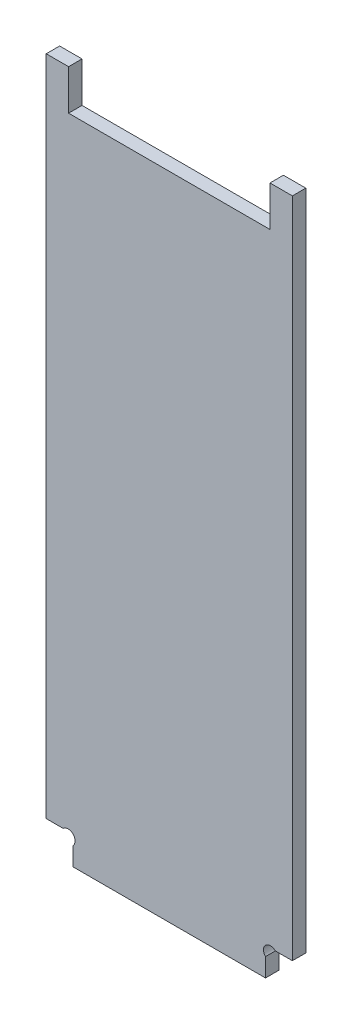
ISO-10303-21;
HEADER;
FILE_DESCRIPTION(('STEP AP214'),'2;1');
FILE_NAME('part.step','',(''),(''),'','','');
FILE_SCHEMA(('AUTOMOTIVE_DESIGN { 1 0 10303 214 1 1 1 1 }'));
ENDSEC;
DATA;
#1=APPLICATION_CONTEXT('core data for automotive mechanical design processes');
#2=APPLICATION_PROTOCOL_DEFINITION('international standard','automotive_design',2000,#1);
#3=PRODUCT_CONTEXT('',#1,'mechanical');
#4=PRODUCT('Part','Part','',(#3));
#5=PRODUCT_RELATED_PRODUCT_CATEGORY('part','',(#4));
#6=PRODUCT_DEFINITION_FORMATION('','',#4);
#7=PRODUCT_DEFINITION_CONTEXT('part definition',#1,'design');
#8=PRODUCT_DEFINITION('design','',#6,#7);
#9=PRODUCT_DEFINITION_SHAPE('','',#8);
#10=(LENGTH_UNIT() NAMED_UNIT(*) SI_UNIT(.MILLI.,.METRE.));
#11=(NAMED_UNIT(*) PLANE_ANGLE_UNIT() SI_UNIT($,.RADIAN.));
#12=(NAMED_UNIT(*) SI_UNIT($,.STERADIAN.) SOLID_ANGLE_UNIT());
#13=UNCERTAINTY_MEASURE_WITH_UNIT(LENGTH_MEASURE(1.E-05),#10,'distance_accuracy_value','');
#14=(GEOMETRIC_REPRESENTATION_CONTEXT(3) GLOBAL_UNCERTAINTY_ASSIGNED_CONTEXT((#13)) GLOBAL_UNIT_ASSIGNED_CONTEXT((#10,
#11,#12)) REPRESENTATION_CONTEXT('',''));
#15=CARTESIAN_POINT('',(0.,0.,0.));
#16=DIRECTION('',(0.,0.,1.));
#17=DIRECTION('',(1.,0.,0.));
#18=AXIS2_PLACEMENT_3D('',#15,#16,#17);
#19=CARTESIAN_POINT('',(5.,139.,3.));
#20=DIRECTION('',(0.,-1.,0.));
#21=DIRECTION('',(1.,0.,0.));
#22=AXIS2_PLACEMENT_3D('',#19,#20,#21);
#23=PLANE('',#22);
#24=DIRECTION('',(-1.,0.,0.));
#25=VECTOR('',#24,1.);
#26=CARTESIAN_POINT('',(5.,139.,0.));
#27=LINE('',#26,#25);
#28=CARTESIAN_POINT('',(49.9999999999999,139.,0.));
#29=VERTEX_POINT('',#28);
#30=CARTESIAN_POINT('',(5.,139.,0.));
#31=VERTEX_POINT('',#30);
#32=EDGE_CURVE('E130',#29,#31,#27,.T.);
#33=ORIENTED_EDGE('',*,*,#32,.T.);
#34=DIRECTION('',(0.,0.,-1.));
#35=VECTOR('',#34,1.);
#36=CARTESIAN_POINT('',(5.,139.,3.));
#37=LINE('',#36,#35);
#38=CARTESIAN_POINT('',(5.,139.,3.));
#39=VERTEX_POINT('',#38);
#40=EDGE_CURVE('E11',#39,#31,#37,.T.);
#41=ORIENTED_EDGE('',*,*,#40,.F.);
#42=DIRECTION('',(-1.,0.,0.));
#43=VECTOR('',#42,1.);
#44=CARTESIAN_POINT('',(5.,139.,3.));
#45=LINE('',#44,#43);
#46=CARTESIAN_POINT('',(49.9999999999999,139.,3.));
#47=VERTEX_POINT('',#46);
#48=EDGE_CURVE('E169',#47,#39,#45,.T.);
#49=ORIENTED_EDGE('',*,*,#48,.F.);
#50=DIRECTION('',(0.,0.,-1.));
#51=VECTOR('',#50,1.);
#52=CARTESIAN_POINT('',(49.9999999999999,139.,3.));
#53=LINE('',#52,#51);
#54=EDGE_CURVE('E143',#47,#29,#53,.T.);
#55=ORIENTED_EDGE('',*,*,#54,.T.);
#56=EDGE_LOOP('',(#33,#41,#49,#55));
#57=FACE_BOUND('',#56,.T.);
#58=ADVANCED_FACE('F26',(#57),#23,.F.);
#59=CARTESIAN_POINT('',(5.,148.,3.));
#60=DIRECTION('',(-1.,0.,0.));
#61=DIRECTION('',(0.,-1.,0.));
#62=AXIS2_PLACEMENT_3D('',#59,#60,#61);
#63=PLANE('',#62);
#64=DIRECTION('',(0.,1.,0.));
#65=VECTOR('',#64,1.);
#66=CARTESIAN_POINT('',(5.,148.,0.));
#67=LINE('',#66,#65);
#68=CARTESIAN_POINT('',(5.,148.,0.));
#69=VERTEX_POINT('',#68);
#70=EDGE_CURVE('E126',#31,#69,#67,.T.);
#71=ORIENTED_EDGE('',*,*,#70,.T.);
#72=DIRECTION('',(0.,0.,-1.));
#73=VECTOR('',#72,1.);
#74=CARTESIAN_POINT('',(5.,148.,3.));
#75=LINE('',#74,#73);
#76=CARTESIAN_POINT('',(5.,148.,3.));
#77=VERTEX_POINT('',#76);
#78=EDGE_CURVE('E33',#77,#69,#75,.T.);
#79=ORIENTED_EDGE('',*,*,#78,.F.);
#80=DIRECTION('',(0.,1.,0.));
#81=VECTOR('',#80,1.);
#82=CARTESIAN_POINT('',(5.,148.,3.));
#83=LINE('',#82,#81);
#84=EDGE_CURVE('E139',#39,#77,#83,.T.);
#85=ORIENTED_EDGE('',*,*,#84,.F.);
#86=ORIENTED_EDGE('',*,*,#40,.T.);
#87=EDGE_LOOP('',(#71,#79,#85,#86));
#88=FACE_BOUND('',#87,.T.);
#89=ADVANCED_FACE('F138',(#88),#63,.F.);
#90=CARTESIAN_POINT('',(0.,148.,3.));
#91=DIRECTION('',(0.,-1.,0.));
#92=DIRECTION('',(0.,0.,-1.));
#93=AXIS2_PLACEMENT_3D('',#90,#91,#92);
#94=PLANE('',#93);
#95=DIRECTION('',(-1.,0.,0.));
#96=VECTOR('',#95,1.);
#97=CARTESIAN_POINT('',(0.,148.,0.));
#98=LINE('',#97,#96);
#99=CARTESIAN_POINT('',(0.,148.,0.));
#100=VERTEX_POINT('',#99);
#101=EDGE_CURVE('E132',#69,#100,#98,.T.);
#102=ORIENTED_EDGE('',*,*,#101,.T.);
#103=DIRECTION('',(0.,0.,-1.));
#104=VECTOR('',#103,1.);
#105=CARTESIAN_POINT('',(0.,148.,3.));
#106=LINE('',#105,#104);
#107=CARTESIAN_POINT('',(0.,148.,3.));
#108=VERTEX_POINT('',#107);
#109=EDGE_CURVE('E225',#108,#100,#106,.T.);
#110=ORIENTED_EDGE('',*,*,#109,.F.);
#111=DIRECTION('',(-1.,0.,0.));
#112=VECTOR('',#111,1.);
#113=CARTESIAN_POINT('',(0.,148.,3.));
#114=LINE('',#113,#112);
#115=EDGE_CURVE('E172',#77,#108,#114,.T.);
#116=ORIENTED_EDGE('',*,*,#115,.F.);
#117=ORIENTED_EDGE('',*,*,#78,.T.);
#118=EDGE_LOOP('',(#102,#110,#116,#117));
#119=FACE_BOUND('',#118,.T.);
#120=ADVANCED_FACE('F229',(#119),#94,.F.);
#121=CARTESIAN_POINT('',(0.,148.,3.));
#122=DIRECTION('',(1.,0.,0.));
#123=DIRECTION('',(0.,1.,0.));
#124=AXIS2_PLACEMENT_3D('',#121,#122,#123);
#125=PLANE('',#124);
#126=DIRECTION('',(0.,-1.,0.));
#127=VECTOR('',#126,1.);
#128=CARTESIAN_POINT('',(0.,148.,0.));
#129=LINE('',#128,#127);
#130=CARTESIAN_POINT('',(0.,0.,0.));
#131=VERTEX_POINT('',#130);
#132=EDGE_CURVE('E147',#100,#131,#129,.T.);
#133=ORIENTED_EDGE('',*,*,#132,.T.);
#134=DIRECTION('',(0.,0.,-1.));
#135=VECTOR('',#134,1.);
#136=CARTESIAN_POINT('',(0.,0.,3.));
#137=LINE('',#136,#135);
#138=CARTESIAN_POINT('',(0.,0.,3.));
#139=VERTEX_POINT('',#138);
#140=EDGE_CURVE('E222',#139,#131,#137,.T.);
#141=ORIENTED_EDGE('',*,*,#140,.F.);
#142=DIRECTION('',(0.,-1.,0.));
#143=VECTOR('',#142,1.);
#144=CARTESIAN_POINT('',(0.,148.,3.));
#145=LINE('',#144,#143);
#146=EDGE_CURVE('E174',#108,#139,#145,.T.);
#147=ORIENTED_EDGE('',*,*,#146,.F.);
#148=ORIENTED_EDGE('',*,*,#109,.T.);
#149=EDGE_LOOP('',(#133,#141,#147,#148));
#150=FACE_BOUND('',#149,.T.);
#151=ADVANCED_FACE('F237',(#150),#125,.F.);
#152=CARTESIAN_POINT('',(0.,0.,3.));
#153=DIRECTION('',(0.,1.,0.));
#154=DIRECTION('',(0.,0.,1.));
#155=AXIS2_PLACEMENT_3D('',#152,#153,#154);
#156=PLANE('',#155);
#157=DIRECTION('',(1.,0.,0.));
#158=VECTOR('',#157,1.);
#159=CARTESIAN_POINT('',(0.,0.,0.));
#160=LINE('',#159,#158);
#161=CARTESIAN_POINT('',(3.80796897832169,0.,0.));
#162=VERTEX_POINT('',#161);
#163=EDGE_CURVE('E149',#131,#162,#160,.T.);
#164=ORIENTED_EDGE('',*,*,#163,.T.);
#165=DIRECTION('',(0.,0.,-1.));
#166=VECTOR('',#165,1.);
#167=CARTESIAN_POINT('',(3.80796897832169,0.,3.));
#168=LINE('',#167,#166);
#169=CARTESIAN_POINT('',(3.80796897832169,0.,3.));
#170=VERTEX_POINT('',#169);
#171=EDGE_CURVE('E219',#170,#162,#168,.T.);
#172=ORIENTED_EDGE('',*,*,#171,.F.);
#173=DIRECTION('',(1.,0.,0.));
#174=VECTOR('',#173,1.);
#175=CARTESIAN_POINT('',(0.,0.,3.));
#176=LINE('',#175,#174);
#177=EDGE_CURVE('E176',#139,#170,#176,.T.);
#178=ORIENTED_EDGE('',*,*,#177,.F.);
#179=ORIENTED_EDGE('',*,*,#140,.T.);
#180=EDGE_LOOP('',(#164,#172,#178,#179));
#181=FACE_BOUND('',#180,.T.);
#182=ADVANCED_FACE('F240',(#181),#156,.F.);
#183=CARTESIAN_POINT('',(4.90398448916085,-1.09601551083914,3.));
#184=DIRECTION('',(0.,0.,-1.));
#185=DIRECTION('',(-1.,0.,0.));
#186=AXIS2_PLACEMENT_3D('',#183,#184,#185);
#187=CYLINDRICAL_SURFACE('',#186,1.55);
#188=CARTESIAN_POINT('',(4.90398448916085,-1.09601551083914,0.));
#189=DIRECTION('',(0.,0.,-1.));
#190=DIRECTION('',(1.,0.,0.));
#191=AXIS2_PLACEMENT_3D('',#188,#189,#190);
#192=CIRCLE('',#191,1.55);
#193=CARTESIAN_POINT('',(6.,-2.19203102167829,0.));
#194=VERTEX_POINT('',#193);
#195=EDGE_CURVE('E151',#162,#194,#192,.T.);
#196=ORIENTED_EDGE('',*,*,#195,.T.);
#197=DIRECTION('',(0.,0.,-1.));
#198=VECTOR('',#197,1.);
#199=CARTESIAN_POINT('',(6.,-2.19203102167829,3.));
#200=LINE('',#199,#198);
#201=CARTESIAN_POINT('',(6.,-2.19203102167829,3.));
#202=VERTEX_POINT('',#201);
#203=EDGE_CURVE('E216',#202,#194,#200,.T.);
#204=ORIENTED_EDGE('',*,*,#203,.F.);
#205=CARTESIAN_POINT('',(4.90398448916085,-1.09601551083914,3.));
#206=DIRECTION('',(0.,0.,-1.));
#207=DIRECTION('',(1.,0.,0.));
#208=AXIS2_PLACEMENT_3D('',#205,#206,#207);
#209=CIRCLE('',#208,1.55);
#210=EDGE_CURVE('E178',#170,#202,#209,.T.);
#211=ORIENTED_EDGE('',*,*,#210,.F.);
#212=ORIENTED_EDGE('',*,*,#171,.T.);
#213=EDGE_LOOP('',(#196,#204,#211,#212));
#214=FACE_BOUND('',#213,.T.);
#215=ADVANCED_FACE('F245',(#214),#187,.F.);
#216=CARTESIAN_POINT('',(6.,-2.19203102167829,3.));
#217=DIRECTION('',(1.,0.,0.));
#218=DIRECTION('',(0.,0.,-1.));
#219=AXIS2_PLACEMENT_3D('',#216,#217,#218);
#220=PLANE('',#219);
#221=DIRECTION('',(0.,-1.,0.));
#222=VECTOR('',#221,1.);
#223=CARTESIAN_POINT('',(6.,-2.19203102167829,0.));
#224=LINE('',#223,#222);
#225=CARTESIAN_POINT('',(6.,-6.33855142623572,0.));
#226=VERTEX_POINT('',#225);
#227=EDGE_CURVE('E153',#194,#226,#224,.T.);
#228=ORIENTED_EDGE('',*,*,#227,.T.);
#229=DIRECTION('',(0.,0.,-1.));
#230=VECTOR('',#229,1.);
#231=CARTESIAN_POINT('',(6.,-6.33855142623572,3.));
#232=LINE('',#231,#230);
#233=CARTESIAN_POINT('',(6.,-6.33855142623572,3.));
#234=VERTEX_POINT('',#233);
#235=EDGE_CURVE('E213',#234,#226,#232,.T.);
#236=ORIENTED_EDGE('',*,*,#235,.F.);
#237=DIRECTION('',(0.,-1.,0.));
#238=VECTOR('',#237,1.);
#239=CARTESIAN_POINT('',(6.,-2.19203102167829,3.));
#240=LINE('',#239,#238);
#241=EDGE_CURVE('E180',#202,#234,#240,.T.);
#242=ORIENTED_EDGE('',*,*,#241,.F.);
#243=ORIENTED_EDGE('',*,*,#203,.T.);
#244=EDGE_LOOP('',(#228,#236,#242,#243));
#245=FACE_BOUND('',#244,.T.);
#246=ADVANCED_FACE('F251',(#245),#220,.F.);
#247=CARTESIAN_POINT('',(6.,-6.33855142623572,3.));
#248=DIRECTION('',(0.,1.,0.));
#249=DIRECTION('',(0.,0.,1.));
#250=AXIS2_PLACEMENT_3D('',#247,#248,#249);
#251=PLANE('',#250);
#252=DIRECTION('',(1.,0.,0.));
#253=VECTOR('',#252,1.);
#254=CARTESIAN_POINT('',(6.,-6.33855142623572,0.));
#255=LINE('',#254,#253);
#256=CARTESIAN_POINT('',(49.,-6.33855142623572,0.));
#257=VERTEX_POINT('',#256);
#258=EDGE_CURVE('E155',#226,#257,#255,.T.);
#259=ORIENTED_EDGE('',*,*,#258,.T.);
#260=DIRECTION('',(0.,0.,-1.));
#261=VECTOR('',#260,1.);
#262=CARTESIAN_POINT('',(49.,-6.33855142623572,3.));
#263=LINE('',#262,#261);
#264=CARTESIAN_POINT('',(49.,-6.33855142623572,3.));
#265=VERTEX_POINT('',#264);
#266=EDGE_CURVE('E210',#265,#257,#263,.T.);
#267=ORIENTED_EDGE('',*,*,#266,.F.);
#268=DIRECTION('',(1.,0.,0.));
#269=VECTOR('',#268,1.);
#270=CARTESIAN_POINT('',(6.,-6.33855142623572,3.));
#271=LINE('',#270,#269);
#272=EDGE_CURVE('E182',#234,#265,#271,.T.);
#273=ORIENTED_EDGE('',*,*,#272,.F.);
#274=ORIENTED_EDGE('',*,*,#235,.T.);
#275=EDGE_LOOP('',(#259,#267,#273,#274));
#276=FACE_BOUND('',#275,.T.);
#277=ADVANCED_FACE('F255',(#276),#251,.F.);
#278=CARTESIAN_POINT('',(49.,-6.33855142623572,3.));
#279=DIRECTION('',(-1.,0.,0.));
#280=DIRECTION('',(0.,0.,1.));
#281=AXIS2_PLACEMENT_3D('',#278,#279,#280);
#282=PLANE('',#281);
#283=DIRECTION('',(0.,1.,0.));
#284=VECTOR('',#283,1.);
#285=CARTESIAN_POINT('',(49.,-6.33855142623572,0.));
#286=LINE('',#285,#284);
#287=CARTESIAN_POINT('',(49.,-2.19203102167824,0.));
#288=VERTEX_POINT('',#287);
#289=EDGE_CURVE('E157',#257,#288,#286,.T.);
#290=ORIENTED_EDGE('',*,*,#289,.T.);
#291=DIRECTION('',(0.,0.,-1.));
#292=VECTOR('',#291,1.);
#293=CARTESIAN_POINT('',(49.,-2.19203102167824,3.));
#294=LINE('',#293,#292);
#295=CARTESIAN_POINT('',(49.,-2.19203102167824,3.));
#296=VERTEX_POINT('',#295);
#297=EDGE_CURVE('E207',#296,#288,#294,.T.);
#298=ORIENTED_EDGE('',*,*,#297,.F.);
#299=DIRECTION('',(0.,1.,0.));
#300=VECTOR('',#299,1.);
#301=CARTESIAN_POINT('',(49.,-6.33855142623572,3.));
#302=LINE('',#301,#300);
#303=EDGE_CURVE('E184',#265,#296,#302,.T.);
#304=ORIENTED_EDGE('',*,*,#303,.F.);
#305=ORIENTED_EDGE('',*,*,#266,.T.);
#306=EDGE_LOOP('',(#290,#298,#304,#305));
#307=FACE_BOUND('',#306,.T.);
#308=ADVANCED_FACE('F260',(#307),#282,.F.);
#309=CARTESIAN_POINT('',(50.0960155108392,-1.09601551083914,3.));
#310=DIRECTION('',(0.,0.,-1.));
#311=DIRECTION('',(-1.,0.,0.));
#312=AXIS2_PLACEMENT_3D('',#309,#310,#311);
#313=CYLINDRICAL_SURFACE('',#312,1.54999999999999);
#314=CARTESIAN_POINT('',(50.0960155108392,-1.09601551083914,0.));
#315=DIRECTION('',(0.,0.,-1.));
#316=DIRECTION('',(-1.,0.,0.));
#317=AXIS2_PLACEMENT_3D('',#314,#315,#316);
#318=CIRCLE('',#317,1.54999999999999);
#319=CARTESIAN_POINT('',(51.1920310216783,0.,0.));
#320=VERTEX_POINT('',#319);
#321=EDGE_CURVE('E159',#288,#320,#318,.T.);
#322=ORIENTED_EDGE('',*,*,#321,.T.);
#323=DIRECTION('',(0.,0.,-1.));
#324=VECTOR('',#323,1.);
#325=CARTESIAN_POINT('',(51.1920310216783,0.,3.));
#326=LINE('',#325,#324);
#327=CARTESIAN_POINT('',(51.1920310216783,0.,3.));
#328=VERTEX_POINT('',#327);
#329=EDGE_CURVE('E204',#328,#320,#326,.T.);
#330=ORIENTED_EDGE('',*,*,#329,.F.);
#331=CARTESIAN_POINT('',(50.0960155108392,-1.09601551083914,3.));
#332=DIRECTION('',(0.,0.,-1.));
#333=DIRECTION('',(-1.,0.,0.));
#334=AXIS2_PLACEMENT_3D('',#331,#332,#333);
#335=CIRCLE('',#334,1.54999999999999);
#336=EDGE_CURVE('E186',#296,#328,#335,.T.);
#337=ORIENTED_EDGE('',*,*,#336,.F.);
#338=ORIENTED_EDGE('',*,*,#297,.T.);
#339=EDGE_LOOP('',(#322,#330,#337,#338));
#340=FACE_BOUND('',#339,.T.);
#341=ADVANCED_FACE('F266',(#340),#313,.F.);
#342=CARTESIAN_POINT('',(51.1920310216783,0.,3.));
#343=DIRECTION('',(0.,1.,0.));
#344=DIRECTION('',(0.,0.,1.));
#345=AXIS2_PLACEMENT_3D('',#342,#343,#344);
#346=PLANE('',#345);
#347=DIRECTION('',(1.,0.,0.));
#348=VECTOR('',#347,1.);
#349=CARTESIAN_POINT('',(51.1920310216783,0.,0.));
#350=LINE('',#349,#348);
#351=CARTESIAN_POINT('',(55.,0.,0.));
#352=VERTEX_POINT('',#351);
#353=EDGE_CURVE('E161',#320,#352,#350,.T.);
#354=ORIENTED_EDGE('',*,*,#353,.T.);
#355=DIRECTION('',(0.,0.,-1.));
#356=VECTOR('',#355,1.);
#357=CARTESIAN_POINT('',(55.,0.,3.));
#358=LINE('',#357,#356);
#359=CARTESIAN_POINT('',(55.,0.,3.));
#360=VERTEX_POINT('',#359);
#361=EDGE_CURVE('E201',#360,#352,#358,.T.);
#362=ORIENTED_EDGE('',*,*,#361,.F.);
#363=DIRECTION('',(1.,0.,0.));
#364=VECTOR('',#363,1.);
#365=CARTESIAN_POINT('',(51.1920310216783,0.,3.));
#366=LINE('',#365,#364);
#367=EDGE_CURVE('E188',#328,#360,#366,.T.);
#368=ORIENTED_EDGE('',*,*,#367,.F.);
#369=ORIENTED_EDGE('',*,*,#329,.T.);
#370=EDGE_LOOP('',(#354,#362,#368,#369));
#371=FACE_BOUND('',#370,.T.);
#372=ADVANCED_FACE('F270',(#371),#346,.F.);
#373=CARTESIAN_POINT('',(55.,148.,3.));
#374=DIRECTION('',(-1.,0.,0.));
#375=DIRECTION('',(0.,0.,1.));
#376=AXIS2_PLACEMENT_3D('',#373,#374,#375);
#377=PLANE('',#376);
#378=DIRECTION('',(0.,1.,0.));
#379=VECTOR('',#378,1.);
#380=CARTESIAN_POINT('',(55.,148.,0.));
#381=LINE('',#380,#379);
#382=CARTESIAN_POINT('',(55.,148.,0.));
#383=VERTEX_POINT('',#382);
#384=EDGE_CURVE('E163',#352,#383,#381,.T.);
#385=ORIENTED_EDGE('',*,*,#384,.T.);
#386=DIRECTION('',(0.,0.,-1.));
#387=VECTOR('',#386,1.);
#388=CARTESIAN_POINT('',(55.,148.,3.));
#389=LINE('',#388,#387);
#390=CARTESIAN_POINT('',(55.,148.,3.));
#391=VERTEX_POINT('',#390);
#392=EDGE_CURVE('E198',#391,#383,#389,.T.);
#393=ORIENTED_EDGE('',*,*,#392,.F.);
#394=DIRECTION('',(0.,1.,0.));
#395=VECTOR('',#394,1.);
#396=CARTESIAN_POINT('',(55.,148.,3.));
#397=LINE('',#396,#395);
#398=EDGE_CURVE('E190',#360,#391,#397,.T.);
#399=ORIENTED_EDGE('',*,*,#398,.F.);
#400=ORIENTED_EDGE('',*,*,#361,.T.);
#401=EDGE_LOOP('',(#385,#393,#399,#400));
#402=FACE_BOUND('',#401,.T.);
#403=ADVANCED_FACE('F275',(#402),#377,.F.);
#404=CARTESIAN_POINT('',(50.,148.,3.));
#405=DIRECTION('',(0.,-1.,0.));
#406=DIRECTION('',(0.,0.,-1.));
#407=AXIS2_PLACEMENT_3D('',#404,#405,#406);
#408=PLANE('',#407);
#409=DIRECTION('',(-1.,0.,0.));
#410=VECTOR('',#409,1.);
#411=CARTESIAN_POINT('',(50.,148.,0.));
#412=LINE('',#411,#410);
#413=CARTESIAN_POINT('',(50.,148.,0.));
#414=VERTEX_POINT('',#413);
#415=EDGE_CURVE('E165',#383,#414,#412,.T.);
#416=ORIENTED_EDGE('',*,*,#415,.T.);
#417=DIRECTION('',(0.,0.,-1.));
#418=VECTOR('',#417,1.);
#419=CARTESIAN_POINT('',(50.,148.,3.));
#420=LINE('',#419,#418);
#421=CARTESIAN_POINT('',(50.,148.,3.));
#422=VERTEX_POINT('',#421);
#423=EDGE_CURVE('E195',#422,#414,#420,.T.);
#424=ORIENTED_EDGE('',*,*,#423,.F.);
#425=DIRECTION('',(-1.,0.,0.));
#426=VECTOR('',#425,1.);
#427=CARTESIAN_POINT('',(50.,148.,3.));
#428=LINE('',#427,#426);
#429=EDGE_CURVE('E45',#391,#422,#428,.T.);
#430=ORIENTED_EDGE('',*,*,#429,.F.);
#431=ORIENTED_EDGE('',*,*,#392,.T.);
#432=EDGE_LOOP('',(#416,#424,#430,#431));
#433=FACE_BOUND('',#432,.T.);
#434=ADVANCED_FACE('F278',(#433),#408,.F.);
#435=CARTESIAN_POINT('',(50.,148.,3.));
#436=DIRECTION('',(1.,0.,0.));
#437=DIRECTION('',(0.,1.,0.));
#438=AXIS2_PLACEMENT_3D('',#435,#436,#437);
#439=PLANE('',#438);
#440=DIRECTION('',(0.,-1.,0.));
#441=VECTOR('',#440,1.);
#442=CARTESIAN_POINT('',(50.,148.,0.));
#443=LINE('',#442,#441);
#444=EDGE_CURVE('E167',#414,#29,#443,.T.);
#445=ORIENTED_EDGE('',*,*,#444,.T.);
#446=ORIENTED_EDGE('',*,*,#54,.F.);
#447=DIRECTION('',(0.,-1.,0.));
#448=VECTOR('',#447,1.);
#449=CARTESIAN_POINT('',(50.,148.,3.));
#450=LINE('',#449,#448);
#451=EDGE_CURVE('E40',#422,#47,#450,.T.);
#452=ORIENTED_EDGE('',*,*,#451,.F.);
#453=ORIENTED_EDGE('',*,*,#423,.T.);
#454=EDGE_LOOP('',(#445,#446,#452,#453));
#455=FACE_BOUND('',#454,.T.);
#456=ADVANCED_FACE('F280',(#455),#439,.F.);
#457=CARTESIAN_POINT('',(50.0960155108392,-1.09601551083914,3.));
#458=DIRECTION('',(0.,0.,-1.));
#459=DIRECTION('',(-1.,0.,0.));
#460=AXIS2_PLACEMENT_3D('',#457,#458,#459);
#461=PLANE('',#460);
#462=ORIENTED_EDGE('',*,*,#48,.T.);
#463=ORIENTED_EDGE('',*,*,#84,.T.);
#464=ORIENTED_EDGE('',*,*,#115,.T.);
#465=ORIENTED_EDGE('',*,*,#146,.T.);
#466=ORIENTED_EDGE('',*,*,#177,.T.);
#467=ORIENTED_EDGE('',*,*,#210,.T.);
#468=ORIENTED_EDGE('',*,*,#241,.T.);
#469=ORIENTED_EDGE('',*,*,#272,.T.);
#470=ORIENTED_EDGE('',*,*,#303,.T.);
#471=ORIENTED_EDGE('',*,*,#336,.T.);
#472=ORIENTED_EDGE('',*,*,#367,.T.);
#473=ORIENTED_EDGE('',*,*,#398,.T.);
#474=ORIENTED_EDGE('',*,*,#429,.T.);
#475=ORIENTED_EDGE('',*,*,#451,.T.);
#476=EDGE_LOOP('',(#462,#463,#464,#465,#466,#467,#468,#469,#470,#471,#472,#473,#474,#475));
#477=FACE_BOUND('',#476,.T.);
#478=ADVANCED_FACE('F232',(#477),#461,.F.);
#479=CARTESIAN_POINT('',(50.0960155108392,-1.09601551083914,0.));
#480=DIRECTION('',(0.,0.,-1.));
#481=DIRECTION('',(-1.,0.,0.));
#482=AXIS2_PLACEMENT_3D('',#479,#480,#481);
#483=PLANE('',#482);
#484=ORIENTED_EDGE('',*,*,#32,.F.);
#485=ORIENTED_EDGE('',*,*,#444,.F.);
#486=ORIENTED_EDGE('',*,*,#415,.F.);
#487=ORIENTED_EDGE('',*,*,#384,.F.);
#488=ORIENTED_EDGE('',*,*,#353,.F.);
#489=ORIENTED_EDGE('',*,*,#321,.F.);
#490=ORIENTED_EDGE('',*,*,#289,.F.);
#491=ORIENTED_EDGE('',*,*,#258,.F.);
#492=ORIENTED_EDGE('',*,*,#227,.F.);
#493=ORIENTED_EDGE('',*,*,#195,.F.);
#494=ORIENTED_EDGE('',*,*,#163,.F.);
#495=ORIENTED_EDGE('',*,*,#132,.F.);
#496=ORIENTED_EDGE('',*,*,#101,.F.);
#497=ORIENTED_EDGE('',*,*,#70,.F.);
#498=EDGE_LOOP('',(#484,#485,#486,#487,#488,#489,#490,#491,#492,#493,#494,#495,#496,#497));
#499=FACE_BOUND('',#498,.T.);
#500=ADVANCED_FACE('F127',(#499),#483,.T.);
#501=CLOSED_SHELL('',(#58,#89,#120,#151,#182,#215,#246,#277,#308,#341,#372,#403,#434,#456,#478,#500));
#502=MANIFOLD_SOLID_BREP('B2',#501);
#503=ADVANCED_BREP_SHAPE_REPRESENTATION('',(#18,#502),#14);
#504=SHAPE_DEFINITION_REPRESENTATION(#9,#503);
ENDSEC;
END-ISO-10303-21;
